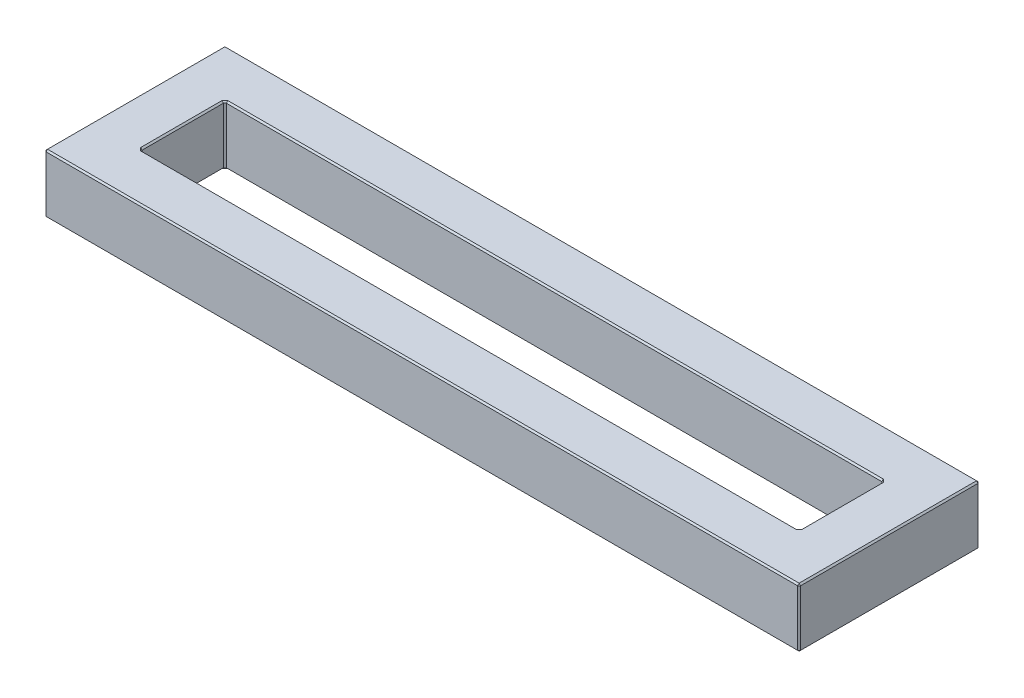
ISO-10303-21;
HEADER;
FILE_DESCRIPTION(('STEP AP214'),'2;1');
FILE_NAME('part.step','',(''),(''),'','','');
FILE_SCHEMA(('AUTOMOTIVE_DESIGN { 1 0 10303 214 1 1 1 1 }'));
ENDSEC;
DATA;
#1=APPLICATION_CONTEXT('core data for automotive mechanical design processes');
#2=APPLICATION_PROTOCOL_DEFINITION('international standard','automotive_design',2000,#1);
#3=PRODUCT_CONTEXT('',#1,'mechanical');
#4=PRODUCT('Part','Part','',(#3));
#5=PRODUCT_RELATED_PRODUCT_CATEGORY('part','',(#4));
#6=PRODUCT_DEFINITION_FORMATION('','',#4);
#7=PRODUCT_DEFINITION_CONTEXT('part definition',#1,'design');
#8=PRODUCT_DEFINITION('design','',#6,#7);
#9=PRODUCT_DEFINITION_SHAPE('','',#8);
#10=(LENGTH_UNIT() NAMED_UNIT(*) SI_UNIT(.MILLI.,.METRE.));
#11=(NAMED_UNIT(*) PLANE_ANGLE_UNIT() SI_UNIT($,.RADIAN.));
#12=(NAMED_UNIT(*) SI_UNIT($,.STERADIAN.) SOLID_ANGLE_UNIT());
#13=UNCERTAINTY_MEASURE_WITH_UNIT(LENGTH_MEASURE(1.E-05),#10,'distance_accuracy_value','');
#14=(GEOMETRIC_REPRESENTATION_CONTEXT(3) GLOBAL_UNCERTAINTY_ASSIGNED_CONTEXT((#13)) GLOBAL_UNIT_ASSIGNED_CONTEXT((#10,
#11,#12)) REPRESENTATION_CONTEXT('',''));
#15=CARTESIAN_POINT('',(0.,0.,0.));
#16=DIRECTION('',(0.,0.,1.));
#17=DIRECTION('',(1.,0.,0.));
#18=AXIS2_PLACEMENT_3D('',#15,#16,#17);
#19=CARTESIAN_POINT('',(0.,9.8,0.));
#20=DIRECTION('',(0.,1.,0.));
#21=DIRECTION('',(0.,0.,1.));
#22=AXIS2_PLACEMENT_3D('',#19,#20,#21);
#23=PLANE('',#22);
#24=DIRECTION('',(1.,0.,0.));
#25=VECTOR('',#24,1.);
#26=CARTESIAN_POINT('',(62.7500000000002,9.8,14.7500000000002));
#27=LINE('',#26,#25);
#28=CARTESIAN_POINT('',(-62.4999999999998,9.8,14.7500000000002));
#29=VERTEX_POINT('',#28);
#30=CARTESIAN_POINT('',(62.5000000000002,9.8,14.7500000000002));
#31=VERTEX_POINT('',#30);
#32=EDGE_CURVE('E563',#29,#31,#27,.T.);
#33=ORIENTED_EDGE('',*,*,#32,.T.);
#34=DIRECTION('',(0.,0.,-1.));
#35=VECTOR('',#34,1.);
#36=CARTESIAN_POINT('',(62.5000000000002,9.8,0.));
#37=LINE('',#36,#35);
#38=CARTESIAN_POINT('',(62.5000000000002,9.8,-14.7499999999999));
#39=VERTEX_POINT('',#38);
#40=EDGE_CURVE('E557',#31,#39,#37,.T.);
#41=ORIENTED_EDGE('',*,*,#40,.T.);
#42=DIRECTION('',(-1.,0.,0.));
#43=VECTOR('',#42,1.);
#44=CARTESIAN_POINT('',(0.,9.8,-14.7499999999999));
#45=LINE('',#44,#43);
#46=CARTESIAN_POINT('',(-62.4999999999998,9.8,-14.7499999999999));
#47=VERTEX_POINT('',#46);
#48=EDGE_CURVE('E570',#39,#47,#45,.T.);
#49=ORIENTED_EDGE('',*,*,#48,.T.);
#50=DIRECTION('',(0.,0.,1.));
#51=VECTOR('',#50,1.);
#52=CARTESIAN_POINT('',(-62.4999999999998,9.8,15.0000000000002));
#53=LINE('',#52,#51);
#54=EDGE_CURVE('E509',#47,#29,#53,.T.);
#55=ORIENTED_EDGE('',*,*,#54,.T.);
#56=EDGE_LOOP('',(#33,#41,#49,#55));
#57=FACE_BOUND('',#56,.T.);
#58=DIRECTION('',(0.707106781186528,0.,0.707106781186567));
#59=VECTOR('',#58,1.);
#60=CARTESIAN_POINT('',(-30.8750000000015,9.8,30.8749999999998));
#61=LINE('',#60,#59);
#62=CARTESIAN_POINT('',(-54.9999999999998,9.8,6.75000000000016));
#63=VERTEX_POINT('',#62);
#64=CARTESIAN_POINT('',(-54.7499999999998,9.8,7.00000000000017));
#65=VERTEX_POINT('',#64);
#66=EDGE_CURVE('E253',#63,#65,#61,.T.);
#67=ORIENTED_EDGE('',*,*,#66,.F.);
#68=DIRECTION('',(0.,0.,-1.));
#69=VECTOR('',#68,1.);
#70=CARTESIAN_POINT('',(-54.9999999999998,9.8,-6.99999999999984));
#71=LINE('',#70,#69);
#72=CARTESIAN_POINT('',(-54.9999999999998,9.8,-6.74999999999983));
#73=VERTEX_POINT('',#72);
#74=EDGE_CURVE('E261',#63,#73,#71,.T.);
#75=ORIENTED_EDGE('',*,*,#74,.T.);
#76=DIRECTION('',(-0.707106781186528,0.,0.707106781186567));
#77=VECTOR('',#76,1.);
#78=CARTESIAN_POINT('',(-30.8750000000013,9.8,-30.8749999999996));
#79=LINE('',#78,#77);
#80=CARTESIAN_POINT('',(-54.7499999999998,9.8,-6.99999999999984));
#81=VERTEX_POINT('',#80);
#82=EDGE_CURVE('E597',#81,#73,#79,.T.);
#83=ORIENTED_EDGE('',*,*,#82,.F.);
#84=DIRECTION('',(-0.707106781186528,0.,0.707106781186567));
#85=VECTOR('',#84,1.);
#86=CARTESIAN_POINT('',(-30.8750000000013,9.8,-30.8749999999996));
#87=LINE('',#86,#85);
#88=CARTESIAN_POINT('',(-54.4999999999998,9.8,-7.24999999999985));
#89=VERTEX_POINT('',#88);
#90=EDGE_CURVE('E583',#89,#81,#87,.T.);
#91=ORIENTED_EDGE('',*,*,#90,.F.);
#92=DIRECTION('',(1.,0.,0.));
#93=VECTOR('',#92,1.);
#94=CARTESIAN_POINT('',(0.,9.8,-7.24999999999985));
#95=LINE('',#94,#93);
#96=CARTESIAN_POINT('',(54.5000000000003,9.8,-7.24999999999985));
#97=VERTEX_POINT('',#96);
#98=EDGE_CURVE('E577',#89,#97,#95,.T.);
#99=ORIENTED_EDGE('',*,*,#98,.T.);
#100=DIRECTION('',(-0.707106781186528,0.,-0.707106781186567));
#101=VECTOR('',#100,1.);
#102=CARTESIAN_POINT('',(30.8750000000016,9.8,-30.8749999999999));
#103=LINE('',#102,#101);
#104=CARTESIAN_POINT('',(54.7500000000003,9.8,-6.99999999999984));
#105=VERTEX_POINT('',#104);
#106=EDGE_CURVE('E562',#105,#97,#103,.T.);
#107=ORIENTED_EDGE('',*,*,#106,.F.);
#108=DIRECTION('',(-0.707106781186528,0.,-0.707106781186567));
#109=VECTOR('',#108,1.);
#110=CARTESIAN_POINT('',(30.8750000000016,9.8,-30.8749999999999));
#111=LINE('',#110,#109);
#112=CARTESIAN_POINT('',(55.0000000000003,9.8,-6.74999999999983));
#113=VERTEX_POINT('',#112);
#114=EDGE_CURVE('E568',#113,#105,#111,.T.);
#115=ORIENTED_EDGE('',*,*,#114,.F.);
#116=DIRECTION('',(0.,0.,1.));
#117=VECTOR('',#116,1.);
#118=CARTESIAN_POINT('',(55.0000000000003,9.8,0.));
#119=LINE('',#118,#117);
#120=CARTESIAN_POINT('',(55.0000000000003,9.8,6.75000000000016));
#121=VERTEX_POINT('',#120);
#122=EDGE_CURVE('E580',#113,#121,#119,.T.);
#123=ORIENTED_EDGE('',*,*,#122,.T.);
#124=DIRECTION('',(0.707106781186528,0.,-0.707106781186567));
#125=VECTOR('',#124,1.);
#126=CARTESIAN_POINT('',(30.8750000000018,9.8,30.875));
#127=LINE('',#126,#125);
#128=CARTESIAN_POINT('',(54.7500000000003,9.8,7.00000000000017));
#129=VERTEX_POINT('',#128);
#130=EDGE_CURVE('E587',#129,#121,#127,.T.);
#131=ORIENTED_EDGE('',*,*,#130,.F.);
#132=DIRECTION('',(0.707106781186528,0.,-0.707106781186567));
#133=VECTOR('',#132,1.);
#134=CARTESIAN_POINT('',(30.8750000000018,9.8,30.875));
#135=LINE('',#134,#133);
#136=CARTESIAN_POINT('',(54.5000000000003,9.8,7.25000000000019));
#137=VERTEX_POINT('',#136);
#138=EDGE_CURVE('E591',#137,#129,#135,.T.);
#139=ORIENTED_EDGE('',*,*,#138,.F.);
#140=DIRECTION('',(-1.,0.,0.));
#141=VECTOR('',#140,1.);
#142=CARTESIAN_POINT('',(-54.7499999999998,9.8,7.25000000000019));
#143=LINE('',#142,#141);
#144=CARTESIAN_POINT('',(-54.4999999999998,9.8,7.25000000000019));
#145=VERTEX_POINT('',#144);
#146=EDGE_CURVE('E256',#137,#145,#143,.T.);
#147=ORIENTED_EDGE('',*,*,#146,.T.);
#148=DIRECTION('',(0.707106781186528,0.,0.707106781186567));
#149=VECTOR('',#148,1.);
#150=CARTESIAN_POINT('',(-30.8750000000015,9.8,30.8749999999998));
#151=LINE('',#150,#149);
#152=EDGE_CURVE('E250',#65,#145,#151,.T.);
#153=ORIENTED_EDGE('',*,*,#152,.F.);
#154=EDGE_LOOP('',(#67,#75,#83,#91,#99,#107,#115,#123,#131,#139,#147,#153));
#155=FACE_BOUND('',#154,.T.);
#156=ADVANCED_FACE('F41',(#57,#155),#23,.T.);
#157=CARTESIAN_POINT('',(0.,0.,0.));
#158=DIRECTION('',(0.,1.,0.));
#159=DIRECTION('',(0.,0.,1.));
#160=AXIS2_PLACEMENT_3D('',#157,#158,#159);
#161=PLANE('',#160);
#162=DIRECTION('',(0.,0.,-1.));
#163=VECTOR('',#162,1.);
#164=CARTESIAN_POINT('',(-62.4999999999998,0.,0.));
#165=LINE('',#164,#163);
#166=CARTESIAN_POINT('',(-62.4999999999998,0.,14.7500000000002));
#167=VERTEX_POINT('',#166);
#168=CARTESIAN_POINT('',(-62.4999999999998,0.,-14.7499999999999));
#169=VERTEX_POINT('',#168);
#170=EDGE_CURVE('E526',#167,#169,#165,.T.);
#171=ORIENTED_EDGE('',*,*,#170,.T.);
#172=DIRECTION('',(1.,0.,0.));
#173=VECTOR('',#172,1.);
#174=CARTESIAN_POINT('',(62.7500000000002,0.,-14.7499999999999));
#175=LINE('',#174,#173);
#176=CARTESIAN_POINT('',(62.5000000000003,0.,-14.7499999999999));
#177=VERTEX_POINT('',#176);
#178=EDGE_CURVE('E689',#169,#177,#175,.T.);
#179=ORIENTED_EDGE('',*,*,#178,.T.);
#180=DIRECTION('',(0.,0.,1.));
#181=VECTOR('',#180,1.);
#182=CARTESIAN_POINT('',(62.5000000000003,0.,15.0000000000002));
#183=LINE('',#182,#181);
#184=CARTESIAN_POINT('',(62.5000000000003,0.,14.7500000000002));
#185=VERTEX_POINT('',#184);
#186=EDGE_CURVE('E684',#177,#185,#183,.T.);
#187=ORIENTED_EDGE('',*,*,#186,.T.);
#188=DIRECTION('',(-1.,0.,0.));
#189=VECTOR('',#188,1.);
#190=CARTESIAN_POINT('',(0.,0.,14.7500000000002));
#191=LINE('',#190,#189);
#192=EDGE_CURVE('E542',#185,#167,#191,.T.);
#193=ORIENTED_EDGE('',*,*,#192,.T.);
#194=EDGE_LOOP('',(#171,#179,#187,#193));
#195=FACE_BOUND('',#194,.T.);
#196=DIRECTION('',(-0.707106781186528,0.,0.707106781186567));
#197=VECTOR('',#196,1.);
#198=CARTESIAN_POINT('',(54.5000000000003,0.,7.25000000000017));
#199=LINE('',#198,#197);
#200=CARTESIAN_POINT('',(54.7500000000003,0.,7.00000000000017));
#201=VERTEX_POINT('',#200);
#202=CARTESIAN_POINT('',(54.5000000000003,0.,7.25000000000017));
#203=VERTEX_POINT('',#202);
#204=EDGE_CURVE('E738',#201,#203,#199,.T.);
#205=ORIENTED_EDGE('',*,*,#204,.F.);
#206=DIRECTION('',(-0.707106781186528,0.,0.707106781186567));
#207=VECTOR('',#206,1.);
#208=CARTESIAN_POINT('',(54.5000000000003,0.,7.25000000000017));
#209=LINE('',#208,#207);
#210=CARTESIAN_POINT('',(55.0000000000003,0.,6.75000000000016));
#211=VERTEX_POINT('',#210);
#212=EDGE_CURVE('E730',#211,#201,#209,.T.);
#213=ORIENTED_EDGE('',*,*,#212,.F.);
#214=DIRECTION('',(0.,0.,-1.));
#215=VECTOR('',#214,1.);
#216=CARTESIAN_POINT('',(55.0000000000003,0.,-6.99999999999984));
#217=LINE('',#216,#215);
#218=CARTESIAN_POINT('',(55.0000000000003,0.,-6.74999999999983));
#219=VERTEX_POINT('',#218);
#220=EDGE_CURVE('E719',#211,#219,#217,.T.);
#221=ORIENTED_EDGE('',*,*,#220,.T.);
#222=DIRECTION('',(0.707106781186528,0.,0.707106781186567));
#223=VECTOR('',#222,1.);
#224=CARTESIAN_POINT('',(55.0000000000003,0.,-6.74999999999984));
#225=LINE('',#224,#223);
#226=CARTESIAN_POINT('',(54.7500000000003,0.,-6.99999999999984));
#227=VERTEX_POINT('',#226);
#228=EDGE_CURVE('E715',#227,#219,#225,.T.);
#229=ORIENTED_EDGE('',*,*,#228,.F.);
#230=DIRECTION('',(0.707106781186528,0.,0.707106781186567));
#231=VECTOR('',#230,1.);
#232=CARTESIAN_POINT('',(55.0000000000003,0.,-6.74999999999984));
#233=LINE('',#232,#231);
#234=CARTESIAN_POINT('',(54.5000000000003,0.,-7.24999999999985));
#235=VERTEX_POINT('',#234);
#236=EDGE_CURVE('E708',#235,#227,#233,.T.);
#237=ORIENTED_EDGE('',*,*,#236,.F.);
#238=DIRECTION('',(-1.,0.,0.));
#239=VECTOR('',#238,1.);
#240=CARTESIAN_POINT('',(-54.7499999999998,0.,-7.24999999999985));
#241=LINE('',#240,#239);
#242=CARTESIAN_POINT('',(-54.4999999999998,0.,-7.24999999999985));
#243=VERTEX_POINT('',#242);
#244=EDGE_CURVE('E705',#235,#243,#241,.T.);
#245=ORIENTED_EDGE('',*,*,#244,.T.);
#246=DIRECTION('',(0.707106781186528,0.,-0.707106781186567));
#247=VECTOR('',#246,1.);
#248=CARTESIAN_POINT('',(-54.4999999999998,0.,-7.24999999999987));
#249=LINE('',#248,#247);
#250=CARTESIAN_POINT('',(-54.7499999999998,0.,-6.99999999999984));
#251=VERTEX_POINT('',#250);
#252=EDGE_CURVE('E694',#251,#243,#249,.T.);
#253=ORIENTED_EDGE('',*,*,#252,.F.);
#254=DIRECTION('',(0.707106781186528,0.,-0.707106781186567));
#255=VECTOR('',#254,1.);
#256=CARTESIAN_POINT('',(-54.4999999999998,0.,-7.24999999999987));
#257=LINE('',#256,#255);
#258=CARTESIAN_POINT('',(-54.9999999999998,0.,-6.74999999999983));
#259=VERTEX_POINT('',#258);
#260=EDGE_CURVE('E698',#259,#251,#257,.T.);
#261=ORIENTED_EDGE('',*,*,#260,.F.);
#262=DIRECTION('',(0.,0.,1.));
#263=VECTOR('',#262,1.);
#264=CARTESIAN_POINT('',(-54.9999999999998,0.,0.));
#265=LINE('',#264,#263);
#266=CARTESIAN_POINT('',(-54.9999999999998,0.,6.75000000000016));
#267=VERTEX_POINT('',#266);
#268=EDGE_CURVE('E712',#259,#267,#265,.T.);
#269=ORIENTED_EDGE('',*,*,#268,.T.);
#270=DIRECTION('',(-0.707106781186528,0.,-0.707106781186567));
#271=VECTOR('',#270,1.);
#272=CARTESIAN_POINT('',(-54.9999999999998,0.,6.75000000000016));
#273=LINE('',#272,#271);
#274=CARTESIAN_POINT('',(-54.7499999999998,0.,7.00000000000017));
#275=VERTEX_POINT('',#274);
#276=EDGE_CURVE('E722',#275,#267,#273,.T.);
#277=ORIENTED_EDGE('',*,*,#276,.F.);
#278=DIRECTION('',(-0.707106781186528,0.,-0.707106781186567));
#279=VECTOR('',#278,1.);
#280=CARTESIAN_POINT('',(-54.9999999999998,0.,6.75000000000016));
#281=LINE('',#280,#279);
#282=CARTESIAN_POINT('',(-54.4999999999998,0.,7.25000000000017));
#283=VERTEX_POINT('',#282);
#284=EDGE_CURVE('E726',#283,#275,#281,.T.);
#285=ORIENTED_EDGE('',*,*,#284,.F.);
#286=DIRECTION('',(1.,0.,0.));
#287=VECTOR('',#286,1.);
#288=CARTESIAN_POINT('',(0.,0.,7.25000000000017));
#289=LINE('',#288,#287);
#290=EDGE_CURVE('E734',#283,#203,#289,.T.);
#291=ORIENTED_EDGE('',*,*,#290,.T.);
#292=EDGE_LOOP('',(#205,#213,#221,#229,#237,#245,#253,#261,#269,#277,#285,#291));
#293=FACE_BOUND('',#292,.T.);
#294=ADVANCED_FACE('F691',(#195,#293),#161,.F.);
#295=CARTESIAN_POINT('',(0.,9.8,7.00000000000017));
#296=DIRECTION('',(0.,0.,1.));
#297=DIRECTION('',(1.,0.,0.));
#298=AXIS2_PLACEMENT_3D('',#295,#296,#297);
#299=PLANE('',#298);
#300=DIRECTION('',(1.,0.,0.));
#301=VECTOR('',#300,1.);
#302=CARTESIAN_POINT('',(54.7500000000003,9.55,7.00000000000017));
#303=LINE('',#302,#301);
#304=CARTESIAN_POINT('',(-54.4999999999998,9.55,7.00000000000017));
#305=VERTEX_POINT('',#304);
#306=CARTESIAN_POINT('',(54.5000000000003,9.55,7.00000000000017));
#307=VERTEX_POINT('',#306);
#308=EDGE_CURVE('E406',#305,#307,#303,.T.);
#309=ORIENTED_EDGE('',*,*,#308,.T.);
#310=DIRECTION('',(0.,-1.,0.));
#311=VECTOR('',#310,1.);
#312=CARTESIAN_POINT('',(54.5000000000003,9.8,7.00000000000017));
#313=LINE('',#312,#311);
#314=CARTESIAN_POINT('',(54.5000000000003,0.250000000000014,7.00000000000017));
#315=VERTEX_POINT('',#314);
#316=EDGE_CURVE('E787',#307,#315,#313,.T.);
#317=ORIENTED_EDGE('',*,*,#316,.T.);
#318=DIRECTION('',(-1.,0.,0.));
#319=VECTOR('',#318,1.);
#320=CARTESIAN_POINT('',(0.,0.250000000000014,7.00000000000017));
#321=LINE('',#320,#319);
#322=CARTESIAN_POINT('',(-54.4999999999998,0.250000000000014,7.00000000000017));
#323=VERTEX_POINT('',#322);
#324=EDGE_CURVE('E791',#315,#323,#321,.T.);
#325=ORIENTED_EDGE('',*,*,#324,.T.);
#326=DIRECTION('',(0.,1.,0.));
#327=VECTOR('',#326,1.);
#328=CARTESIAN_POINT('',(-54.4999999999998,9.8,7.00000000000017));
#329=LINE('',#328,#327);
#330=EDGE_CURVE('E639',#323,#305,#329,.T.);
#331=ORIENTED_EDGE('',*,*,#330,.T.);
#332=EDGE_LOOP('',(#309,#317,#325,#331));
#333=FACE_BOUND('',#332,.T.);
#334=ADVANCED_FACE('F798',(#333),#299,.F.);
#335=CARTESIAN_POINT('',(-54.7499999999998,9.8,0.));
#336=DIRECTION('',(-1.,0.,0.));
#337=DIRECTION('',(0.,0.,1.));
#338=AXIS2_PLACEMENT_3D('',#335,#336,#337);
#339=PLANE('',#338);
#340=DIRECTION('',(0.,0.,1.));
#341=VECTOR('',#340,1.);
#342=CARTESIAN_POINT('',(-54.7499999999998,9.55,7.00000000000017));
#343=LINE('',#342,#341);
#344=CARTESIAN_POINT('',(-54.7499999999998,9.55,-6.74999999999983));
#345=VERTEX_POINT('',#344);
#346=CARTESIAN_POINT('',(-54.7499999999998,9.55,6.75000000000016));
#347=VERTEX_POINT('',#346);
#348=EDGE_CURVE('E605',#345,#347,#343,.T.);
#349=ORIENTED_EDGE('',*,*,#348,.T.);
#350=DIRECTION('',(0.,-1.,0.));
#351=VECTOR('',#350,1.);
#352=CARTESIAN_POINT('',(-54.7499999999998,0.,6.75000000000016));
#353=LINE('',#352,#351);
#354=CARTESIAN_POINT('',(-54.7499999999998,0.250000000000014,6.75000000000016));
#355=VERTEX_POINT('',#354);
#356=EDGE_CURVE('E641',#347,#355,#353,.T.);
#357=ORIENTED_EDGE('',*,*,#356,.T.);
#358=DIRECTION('',(0.,0.,-1.));
#359=VECTOR('',#358,1.);
#360=CARTESIAN_POINT('',(-54.7499999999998,0.250000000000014,0.));
#361=LINE('',#360,#359);
#362=CARTESIAN_POINT('',(-54.7499999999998,0.250000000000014,-6.74999999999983));
#363=VERTEX_POINT('',#362);
#364=EDGE_CURVE('E646',#355,#363,#361,.T.);
#365=ORIENTED_EDGE('',*,*,#364,.T.);
#366=DIRECTION('',(0.,1.,0.));
#367=VECTOR('',#366,1.);
#368=CARTESIAN_POINT('',(-54.7499999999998,9.8,-6.74999999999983));
#369=LINE('',#368,#367);
#370=EDGE_CURVE('E651',#363,#345,#369,.T.);
#371=ORIENTED_EDGE('',*,*,#370,.T.);
#372=EDGE_LOOP('',(#349,#357,#365,#371));
#373=FACE_BOUND('',#372,.T.);
#374=ADVANCED_FACE('F745',(#373),#339,.F.);
#375=CARTESIAN_POINT('',(0.,9.8,-6.99999999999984));
#376=DIRECTION('',(0.,0.,1.));
#377=DIRECTION('',(1.,0.,0.));
#378=AXIS2_PLACEMENT_3D('',#375,#376,#377);
#379=PLANE('',#378);
#380=DIRECTION('',(-1.,0.,0.));
#381=VECTOR('',#380,1.);
#382=CARTESIAN_POINT('',(0.,9.55,-6.99999999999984));
#383=LINE('',#382,#381);
#384=CARTESIAN_POINT('',(54.5000000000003,9.55,-6.99999999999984));
#385=VERTEX_POINT('',#384);
#386=CARTESIAN_POINT('',(-54.4999999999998,9.55,-6.99999999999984));
#387=VERTEX_POINT('',#386);
#388=EDGE_CURVE('E614',#385,#387,#383,.T.);
#389=ORIENTED_EDGE('',*,*,#388,.T.);
#390=DIRECTION('',(0.,-1.,0.));
#391=VECTOR('',#390,1.);
#392=CARTESIAN_POINT('',(-54.4999999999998,9.8,-6.99999999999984));
#393=LINE('',#392,#391);
#394=CARTESIAN_POINT('',(-54.4999999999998,0.25,-6.99999999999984));
#395=VERTEX_POINT('',#394);
#396=EDGE_CURVE('E660',#387,#395,#393,.T.);
#397=ORIENTED_EDGE('',*,*,#396,.T.);
#398=DIRECTION('',(1.,0.,0.));
#399=VECTOR('',#398,1.);
#400=CARTESIAN_POINT('',(54.7500000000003,0.25,-6.99999999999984));
#401=LINE('',#400,#399);
#402=CARTESIAN_POINT('',(54.5000000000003,0.25,-6.99999999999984));
#403=VERTEX_POINT('',#402);
#404=EDGE_CURVE('E657',#395,#403,#401,.T.);
#405=ORIENTED_EDGE('',*,*,#404,.T.);
#406=DIRECTION('',(0.,1.,0.));
#407=VECTOR('',#406,1.);
#408=CARTESIAN_POINT('',(54.5000000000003,9.8,-6.99999999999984));
#409=LINE('',#408,#407);
#410=EDGE_CURVE('E645',#403,#385,#409,.T.);
#411=ORIENTED_EDGE('',*,*,#410,.T.);
#412=EDGE_LOOP('',(#389,#397,#405,#411));
#413=FACE_BOUND('',#412,.T.);
#414=ADVANCED_FACE('F751',(#413),#379,.T.);
#415=CARTESIAN_POINT('',(62.7500000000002,9.8,0.));
#416=DIRECTION('',(1.,0.,0.));
#417=DIRECTION('',(0.,0.,-1.));
#418=AXIS2_PLACEMENT_3D('',#415,#416,#417);
#419=PLANE('',#418);
#420=DIRECTION('',(0.,0.,-1.));
#421=VECTOR('',#420,1.);
#422=CARTESIAN_POINT('',(62.7500000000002,0.249999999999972,-14.9999999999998));
#423=LINE('',#422,#421);
#424=CARTESIAN_POINT('',(62.7500000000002,0.249999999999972,14.7500000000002));
#425=VERTEX_POINT('',#424);
#426=CARTESIAN_POINT('',(62.7500000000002,0.249999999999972,-14.7499999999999));
#427=VERTEX_POINT('',#426);
#428=EDGE_CURVE('E291',#425,#427,#423,.T.);
#429=ORIENTED_EDGE('',*,*,#428,.T.);
#430=DIRECTION('',(0.,1.,0.));
#431=VECTOR('',#430,1.);
#432=CARTESIAN_POINT('',(62.7500000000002,9.8,-14.7499999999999));
#433=LINE('',#432,#431);
#434=CARTESIAN_POINT('',(62.7500000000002,9.55000000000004,-14.7499999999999));
#435=VERTEX_POINT('',#434);
#436=EDGE_CURVE('E294',#427,#435,#433,.T.);
#437=ORIENTED_EDGE('',*,*,#436,.T.);
#438=DIRECTION('',(0.,0.,1.));
#439=VECTOR('',#438,1.);
#440=CARTESIAN_POINT('',(62.7500000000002,9.55000000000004,0.));
#441=LINE('',#440,#439);
#442=CARTESIAN_POINT('',(62.7500000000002,9.55000000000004,14.7500000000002));
#443=VERTEX_POINT('',#442);
#444=EDGE_CURVE('E285',#435,#443,#441,.T.);
#445=ORIENTED_EDGE('',*,*,#444,.T.);
#446=DIRECTION('',(0.,-1.,0.));
#447=VECTOR('',#446,1.);
#448=CARTESIAN_POINT('',(62.7500000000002,0.,14.7500000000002));
#449=LINE('',#448,#447);
#450=EDGE_CURVE('E288',#443,#425,#449,.T.);
#451=ORIENTED_EDGE('',*,*,#450,.T.);
#452=EDGE_LOOP('',(#429,#437,#445,#451));
#453=FACE_BOUND('',#452,.T.);
#454=ADVANCED_FACE('F849',(#453),#419,.T.);
#455=CARTESIAN_POINT('',(0.,9.8,-14.9999999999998));
#456=DIRECTION('',(0.,0.,-1.));
#457=DIRECTION('',(-1.,0.,0.));
#458=AXIS2_PLACEMENT_3D('',#455,#456,#457);
#459=PLANE('',#458);
#460=DIRECTION('',(0.,-1.,0.));
#461=VECTOR('',#460,1.);
#462=CARTESIAN_POINT('',(62.5000000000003,9.8,-14.9999999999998));
#463=LINE('',#462,#461);
#464=CARTESIAN_POINT('',(62.5000000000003,9.55000000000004,-14.9999999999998));
#465=VERTEX_POINT('',#464);
#466=CARTESIAN_POINT('',(62.5000000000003,0.249999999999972,-14.9999999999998));
#467=VERTEX_POINT('',#466);
#468=EDGE_CURVE('E278',#465,#467,#463,.T.);
#469=ORIENTED_EDGE('',*,*,#468,.T.);
#470=DIRECTION('',(-1.,0.,0.));
#471=VECTOR('',#470,1.);
#472=CARTESIAN_POINT('',(-62.7499999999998,0.249999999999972,-14.9999999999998));
#473=LINE('',#472,#471);
#474=CARTESIAN_POINT('',(-62.4999999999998,0.249999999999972,-14.9999999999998));
#475=VERTEX_POINT('',#474);
#476=EDGE_CURVE('E281',#467,#475,#473,.T.);
#477=ORIENTED_EDGE('',*,*,#476,.T.);
#478=DIRECTION('',(0.,1.,0.));
#479=VECTOR('',#478,1.);
#480=CARTESIAN_POINT('',(-62.4999999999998,9.8,-14.9999999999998));
#481=LINE('',#480,#479);
#482=CARTESIAN_POINT('',(-62.4999999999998,9.55000000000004,-14.9999999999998));
#483=VERTEX_POINT('',#482);
#484=EDGE_CURVE('E269',#475,#483,#481,.T.);
#485=ORIENTED_EDGE('',*,*,#484,.T.);
#486=DIRECTION('',(1.,0.,0.));
#487=VECTOR('',#486,1.);
#488=CARTESIAN_POINT('',(0.,9.55000000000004,-14.9999999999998));
#489=LINE('',#488,#487);
#490=EDGE_CURVE('E272',#483,#465,#489,.T.);
#491=ORIENTED_EDGE('',*,*,#490,.T.);
#492=EDGE_LOOP('',(#469,#477,#485,#491));
#493=FACE_BOUND('',#492,.T.);
#494=ADVANCED_FACE('F672',(#493),#459,.T.);
#495=CARTESIAN_POINT('',(-62.7499999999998,9.8,0.));
#496=DIRECTION('',(1.,0.,0.));
#497=DIRECTION('',(0.,0.,-1.));
#498=AXIS2_PLACEMENT_3D('',#495,#496,#497);
#499=PLANE('',#498);
#500=DIRECTION('',(0.,-1.,0.));
#501=VECTOR('',#500,1.);
#502=CARTESIAN_POINT('',(-62.7499999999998,0.,-14.7499999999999));
#503=LINE('',#502,#501);
#504=CARTESIAN_POINT('',(-62.7499999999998,9.55000000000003,-14.7499999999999));
#505=VERTEX_POINT('',#504);
#506=CARTESIAN_POINT('',(-62.7499999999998,0.249999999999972,-14.7499999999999));
#507=VERTEX_POINT('',#506);
#508=EDGE_CURVE('E51',#505,#507,#503,.T.);
#509=ORIENTED_EDGE('',*,*,#508,.T.);
#510=DIRECTION('',(0.,0.,1.));
#511=VECTOR('',#510,1.);
#512=CARTESIAN_POINT('',(-62.7499999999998,0.249999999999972,0.));
#513=LINE('',#512,#511);
#514=CARTESIAN_POINT('',(-62.7499999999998,0.249999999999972,14.7500000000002));
#515=VERTEX_POINT('',#514);
#516=EDGE_CURVE('E11',#507,#515,#513,.T.);
#517=ORIENTED_EDGE('',*,*,#516,.T.);
#518=DIRECTION('',(0.,1.,0.));
#519=VECTOR('',#518,1.);
#520=CARTESIAN_POINT('',(-62.7499999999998,9.8,14.7500000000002));
#521=LINE('',#520,#519);
#522=CARTESIAN_POINT('',(-62.7499999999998,9.55000000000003,14.7500000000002));
#523=VERTEX_POINT('',#522);
#524=EDGE_CURVE('E311',#515,#523,#521,.T.);
#525=ORIENTED_EDGE('',*,*,#524,.T.);
#526=DIRECTION('',(0.,0.,-1.));
#527=VECTOR('',#526,1.);
#528=CARTESIAN_POINT('',(-62.7499999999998,9.55000000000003,-14.9999999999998));
#529=LINE('',#528,#527);
#530=EDGE_CURVE('E62',#523,#505,#529,.T.);
#531=ORIENTED_EDGE('',*,*,#530,.T.);
#532=EDGE_LOOP('',(#509,#517,#525,#531));
#533=FACE_BOUND('',#532,.T.);
#534=ADVANCED_FACE('F528',(#533),#499,.F.);
#535=CARTESIAN_POINT('',(0.,9.8,15.0000000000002));
#536=DIRECTION('',(0.,0.,-1.));
#537=DIRECTION('',(-1.,0.,0.));
#538=AXIS2_PLACEMENT_3D('',#535,#536,#537);
#539=PLANE('',#538);
#540=DIRECTION('',(1.,0.,0.));
#541=VECTOR('',#540,1.);
#542=CARTESIAN_POINT('',(0.,0.249999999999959,15.0000000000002));
#543=LINE('',#542,#541);
#544=CARTESIAN_POINT('',(-62.4999999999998,0.249999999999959,15.0000000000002));
#545=VERTEX_POINT('',#544);
#546=CARTESIAN_POINT('',(62.5000000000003,0.249999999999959,15.0000000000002));
#547=VERTEX_POINT('',#546);
#548=EDGE_CURVE('E304',#545,#547,#543,.T.);
#549=ORIENTED_EDGE('',*,*,#548,.T.);
#550=DIRECTION('',(0.,1.,0.));
#551=VECTOR('',#550,1.);
#552=CARTESIAN_POINT('',(62.5000000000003,9.8,15.0000000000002));
#553=LINE('',#552,#551);
#554=CARTESIAN_POINT('',(62.5000000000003,9.55000000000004,15.0000000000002));
#555=VERTEX_POINT('',#554);
#556=EDGE_CURVE('E307',#547,#555,#553,.T.);
#557=ORIENTED_EDGE('',*,*,#556,.T.);
#558=DIRECTION('',(-1.,0.,0.));
#559=VECTOR('',#558,1.);
#560=CARTESIAN_POINT('',(-62.7499999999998,9.55000000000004,15.0000000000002));
#561=LINE('',#560,#559);
#562=CARTESIAN_POINT('',(-62.4999999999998,9.55000000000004,15.0000000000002));
#563=VERTEX_POINT('',#562);
#564=EDGE_CURVE('E301',#555,#563,#561,.T.);
#565=ORIENTED_EDGE('',*,*,#564,.T.);
#566=DIRECTION('',(0.,-1.,0.));
#567=VECTOR('',#566,1.);
#568=CARTESIAN_POINT('',(-62.4999999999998,9.8,15.0000000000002));
#569=LINE('',#568,#567);
#570=EDGE_CURVE('E298',#563,#545,#569,.T.);
#571=ORIENTED_EDGE('',*,*,#570,.T.);
#572=EDGE_LOOP('',(#549,#557,#565,#571));
#573=FACE_BOUND('',#572,.T.);
#574=ADVANCED_FACE('F535',(#573),#539,.F.);
#575=CARTESIAN_POINT('',(54.7500000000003,9.8,0.));
#576=DIRECTION('',(-1.,0.,0.));
#577=DIRECTION('',(0.,0.,1.));
#578=AXIS2_PLACEMENT_3D('',#575,#576,#577);
#579=PLANE('',#578);
#580=DIRECTION('',(0.,0.,1.));
#581=VECTOR('',#580,1.);
#582=CARTESIAN_POINT('',(54.7500000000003,0.250000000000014,7.00000000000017));
#583=LINE('',#582,#581);
#584=CARTESIAN_POINT('',(54.7500000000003,0.250000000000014,-6.74999999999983));
#585=VERTEX_POINT('',#584);
#586=CARTESIAN_POINT('',(54.7500000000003,0.250000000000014,6.75000000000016));
#587=VERTEX_POINT('',#586);
#588=EDGE_CURVE('E769',#585,#587,#583,.T.);
#589=ORIENTED_EDGE('',*,*,#588,.T.);
#590=DIRECTION('',(0.,1.,0.));
#591=VECTOR('',#590,1.);
#592=CARTESIAN_POINT('',(54.7500000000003,9.8,6.75000000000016));
#593=LINE('',#592,#591);
#594=CARTESIAN_POINT('',(54.7500000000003,9.54999999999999,6.75000000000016));
#595=VERTEX_POINT('',#594);
#596=EDGE_CURVE('E774',#587,#595,#593,.T.);
#597=ORIENTED_EDGE('',*,*,#596,.T.);
#598=DIRECTION('',(0.,0.,-1.));
#599=VECTOR('',#598,1.);
#600=CARTESIAN_POINT('',(54.7500000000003,9.54999999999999,0.));
#601=LINE('',#600,#599);
#602=CARTESIAN_POINT('',(54.7500000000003,9.54999999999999,-6.74999999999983));
#603=VERTEX_POINT('',#602);
#604=EDGE_CURVE('E624',#595,#603,#601,.T.);
#605=ORIENTED_EDGE('',*,*,#604,.T.);
#606=DIRECTION('',(0.,-1.,0.));
#607=VECTOR('',#606,1.);
#608=CARTESIAN_POINT('',(54.7500000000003,0.,-6.74999999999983));
#609=LINE('',#608,#607);
#610=EDGE_CURVE('E779',#603,#585,#609,.T.);
#611=ORIENTED_EDGE('',*,*,#610,.T.);
#612=EDGE_LOOP('',(#589,#597,#605,#611));
#613=FACE_BOUND('',#612,.T.);
#614=ADVANCED_FACE('F820',(#613),#579,.T.);
#615=CARTESIAN_POINT('',(-54.4999999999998,9.8,-6.99999999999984));
#616=DIRECTION('',(-0.707106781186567,0.,-0.707106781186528));
#617=DIRECTION('',(0.,-1.,0.));
#618=AXIS2_PLACEMENT_3D('',#615,#616,#617);
#619=PLANE('',#618);
#620=DIRECTION('',(0.707106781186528,0.,-0.707106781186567));
#621=VECTOR('',#620,1.);
#622=CARTESIAN_POINT('',(-54.4999999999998,9.55,-6.99999999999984));
#623=LINE('',#622,#621);
#624=EDGE_CURVE('E402',#345,#387,#623,.T.);
#625=ORIENTED_EDGE('',*,*,#624,.F.);
#626=ORIENTED_EDGE('',*,*,#370,.F.);
#627=DIRECTION('',(-0.707106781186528,0.,0.707106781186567));
#628=VECTOR('',#627,1.);
#629=CARTESIAN_POINT('',(-54.4999999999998,0.25,-6.99999999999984));
#630=LINE('',#629,#628);
#631=EDGE_CURVE('E398',#395,#363,#630,.T.);
#632=ORIENTED_EDGE('',*,*,#631,.F.);
#633=ORIENTED_EDGE('',*,*,#396,.F.);
#634=EDGE_LOOP('',(#625,#626,#632,#633));
#635=FACE_BOUND('',#634,.T.);
#636=ADVANCED_FACE('F749',(#635),#619,.F.);
#637=CARTESIAN_POINT('',(-54.7499999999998,9.55,-6.74999999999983));
#638=DIRECTION('',(0.577350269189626,0.577350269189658,0.577350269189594));
#639=DIRECTION('',(-0.707106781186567,0.707106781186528,0.));
#640=AXIS2_PLACEMENT_3D('',#637,#638,#639);
#641=PLANE('',#640);
#642=DIRECTION('',(0.707106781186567,-0.707106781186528,0.));
#643=VECTOR('',#642,1.);
#644=CARTESIAN_POINT('',(-54.9999999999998,9.8,-6.74999999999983));
#645=LINE('',#644,#643);
#646=EDGE_CURVE('E391',#345,#73,#645,.F.);
#647=ORIENTED_EDGE('',*,*,#646,.F.);
#648=ORIENTED_EDGE('',*,*,#624,.T.);
#649=DIRECTION('',(0.,0.707106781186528,-0.707106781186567));
#650=VECTOR('',#649,1.);
#651=CARTESIAN_POINT('',(-54.4999999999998,9.55,-6.99999999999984));
#652=LINE('',#651,#650);
#653=EDGE_CURVE('E394',#89,#387,#652,.F.);
#654=ORIENTED_EDGE('',*,*,#653,.F.);
#655=ORIENTED_EDGE('',*,*,#90,.T.);
#656=ORIENTED_EDGE('',*,*,#82,.T.);
#657=EDGE_LOOP('',(#647,#648,#654,#655,#656));
#658=FACE_BOUND('',#657,.T.);
#659=ADVANCED_FACE('F607',(#658),#641,.T.);
#660=CARTESIAN_POINT('',(-54.4999999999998,0.25,-6.99999999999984));
#661=DIRECTION('',(0.577350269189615,-0.577350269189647,0.577350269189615));
#662=DIRECTION('',(0.,-0.707106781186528,-0.707106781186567));
#663=AXIS2_PLACEMENT_3D('',#660,#661,#662);
#664=PLANE('',#663);
#665=DIRECTION('',(0.,0.707106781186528,0.707106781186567));
#666=VECTOR('',#665,1.);
#667=CARTESIAN_POINT('',(-54.4999999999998,0.,-7.24999999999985));
#668=LINE('',#667,#666);
#669=EDGE_CURVE('E383',#395,#243,#668,.F.);
#670=ORIENTED_EDGE('',*,*,#669,.F.);
#671=ORIENTED_EDGE('',*,*,#631,.T.);
#672=DIRECTION('',(-0.707106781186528,-0.707106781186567,0.));
#673=VECTOR('',#672,1.);
#674=CARTESIAN_POINT('',(-54.7499999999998,0.250000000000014,-6.74999999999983));
#675=LINE('',#674,#673);
#676=EDGE_CURVE('E387',#259,#363,#675,.F.);
#677=ORIENTED_EDGE('',*,*,#676,.F.);
#678=ORIENTED_EDGE('',*,*,#260,.T.);
#679=ORIENTED_EDGE('',*,*,#252,.T.);
#680=EDGE_LOOP('',(#670,#671,#677,#678,#679));
#681=FACE_BOUND('',#680,.T.);
#682=ADVANCED_FACE('F814',(#681),#664,.T.);
#683=CARTESIAN_POINT('',(0.,9.55,-6.99999999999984));
#684=DIRECTION('',(0.,-0.707106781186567,-0.707106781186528));
#685=DIRECTION('',(-1.,0.,0.));
#686=AXIS2_PLACEMENT_3D('',#683,#684,#685);
#687=PLANE('',#686);
#688=ORIENTED_EDGE('',*,*,#653,.T.);
#689=ORIENTED_EDGE('',*,*,#388,.F.);
#690=DIRECTION('',(0.,-0.707106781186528,0.707106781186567));
#691=VECTOR('',#690,1.);
#692=CARTESIAN_POINT('',(54.5000000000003,9.8,-7.24999999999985));
#693=LINE('',#692,#691);
#694=EDGE_CURVE('E375',#97,#385,#693,.T.);
#695=ORIENTED_EDGE('',*,*,#694,.F.);
#696=ORIENTED_EDGE('',*,*,#98,.F.);
#697=EDGE_LOOP('',(#688,#689,#695,#696));
#698=FACE_BOUND('',#697,.T.);
#699=ADVANCED_FACE('F613',(#698),#687,.F.);
#700=CARTESIAN_POINT('',(-54.9999999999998,9.8,0.));
#701=DIRECTION('',(0.707106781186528,0.707106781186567,0.));
#702=DIRECTION('',(0.,0.,1.));
#703=AXIS2_PLACEMENT_3D('',#700,#701,#702);
#704=PLANE('',#703);
#705=ORIENTED_EDGE('',*,*,#646,.T.);
#706=ORIENTED_EDGE('',*,*,#74,.F.);
#707=DIRECTION('',(-0.707106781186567,0.707106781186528,0.));
#708=VECTOR('',#707,1.);
#709=CARTESIAN_POINT('',(-54.7499999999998,9.55,6.75000000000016));
#710=LINE('',#709,#708);
#711=EDGE_CURVE('E267',#347,#63,#710,.T.);
#712=ORIENTED_EDGE('',*,*,#711,.F.);
#713=ORIENTED_EDGE('',*,*,#348,.F.);
#714=EDGE_LOOP('',(#705,#706,#712,#713));
#715=FACE_BOUND('',#714,.T.);
#716=ADVANCED_FACE('F602',(#715),#704,.T.);
#717=CARTESIAN_POINT('',(-54.7499999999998,9.8,6.75000000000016));
#718=DIRECTION('',(0.707106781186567,0.,-0.707106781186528));
#719=DIRECTION('',(0.,1.,0.));
#720=AXIS2_PLACEMENT_3D('',#717,#718,#719);
#721=PLANE('',#720);
#722=DIRECTION('',(-0.707106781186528,0.,-0.707106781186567));
#723=VECTOR('',#722,1.);
#724=CARTESIAN_POINT('',(-54.7499999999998,0.250000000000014,6.75000000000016));
#725=LINE('',#724,#723);
#726=EDGE_CURVE('E366',#355,#323,#725,.F.);
#727=ORIENTED_EDGE('',*,*,#726,.F.);
#728=ORIENTED_EDGE('',*,*,#356,.F.);
#729=DIRECTION('',(0.707106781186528,0.,0.707106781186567));
#730=VECTOR('',#729,1.);
#731=CARTESIAN_POINT('',(-54.7499999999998,9.55,6.75000000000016));
#732=LINE('',#731,#730);
#733=EDGE_CURVE('E370',#305,#347,#732,.F.);
#734=ORIENTED_EDGE('',*,*,#733,.F.);
#735=ORIENTED_EDGE('',*,*,#330,.F.);
#736=EDGE_LOOP('',(#727,#728,#734,#735));
#737=FACE_BOUND('',#736,.T.);
#738=ADVANCED_FACE('F638',(#737),#721,.T.);
#739=CARTESIAN_POINT('',(-54.7499999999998,0.250000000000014,0.));
#740=DIRECTION('',(-0.707106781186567,0.707106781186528,0.));
#741=DIRECTION('',(0.,0.,-1.));
#742=AXIS2_PLACEMENT_3D('',#739,#740,#741);
#743=PLANE('',#742);
#744=ORIENTED_EDGE('',*,*,#676,.T.);
#745=ORIENTED_EDGE('',*,*,#364,.F.);
#746=DIRECTION('',(0.707106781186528,0.707106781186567,0.));
#747=VECTOR('',#746,1.);
#748=CARTESIAN_POINT('',(-54.9999999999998,0.,6.75000000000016));
#749=LINE('',#748,#747);
#750=EDGE_CURVE('E363',#267,#355,#749,.T.);
#751=ORIENTED_EDGE('',*,*,#750,.F.);
#752=ORIENTED_EDGE('',*,*,#268,.F.);
#753=EDGE_LOOP('',(#744,#745,#751,#752));
#754=FACE_BOUND('',#753,.T.);
#755=ADVANCED_FACE('F811',(#754),#743,.F.);
#756=CARTESIAN_POINT('',(0.,0.,-7.24999999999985));
#757=DIRECTION('',(0.,-0.707106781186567,0.707106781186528));
#758=DIRECTION('',(1.,0.,0.));
#759=AXIS2_PLACEMENT_3D('',#756,#757,#758);
#760=PLANE('',#759);
#761=ORIENTED_EDGE('',*,*,#669,.T.);
#762=ORIENTED_EDGE('',*,*,#244,.F.);
#763=DIRECTION('',(0.,-0.707106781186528,-0.707106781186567));
#764=VECTOR('',#763,1.);
#765=CARTESIAN_POINT('',(54.5000000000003,0.25,-6.99999999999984));
#766=LINE('',#765,#764);
#767=EDGE_CURVE('E359',#403,#235,#766,.T.);
#768=ORIENTED_EDGE('',*,*,#767,.F.);
#769=ORIENTED_EDGE('',*,*,#404,.F.);
#770=EDGE_LOOP('',(#761,#762,#768,#769));
#771=FACE_BOUND('',#770,.T.);
#772=ADVANCED_FACE('F761',(#771),#760,.T.);
#773=CARTESIAN_POINT('',(54.7500000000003,9.8,-6.74999999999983));
#774=DIRECTION('',(-0.707106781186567,0.,0.707106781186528));
#775=DIRECTION('',(0.,1.,0.));
#776=AXIS2_PLACEMENT_3D('',#773,#774,#775);
#777=PLANE('',#776);
#778=DIRECTION('',(-0.707106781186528,0.,-0.707106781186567));
#779=VECTOR('',#778,1.);
#780=CARTESIAN_POINT('',(54.7500000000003,9.55,-6.74999999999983));
#781=LINE('',#780,#779);
#782=EDGE_CURVE('E379',#385,#603,#781,.F.);
#783=ORIENTED_EDGE('',*,*,#782,.F.);
#784=ORIENTED_EDGE('',*,*,#410,.F.);
#785=DIRECTION('',(0.707106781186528,0.,0.707106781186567));
#786=VECTOR('',#785,1.);
#787=CARTESIAN_POINT('',(54.7500000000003,0.250000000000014,-6.74999999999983));
#788=LINE('',#787,#786);
#789=EDGE_CURVE('E355',#585,#403,#788,.F.);
#790=ORIENTED_EDGE('',*,*,#789,.F.);
#791=ORIENTED_EDGE('',*,*,#610,.F.);
#792=EDGE_LOOP('',(#783,#784,#790,#791));
#793=FACE_BOUND('',#792,.T.);
#794=ADVANCED_FACE('F756',(#793),#777,.T.);
#795=CARTESIAN_POINT('',(54.5000000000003,9.55,-6.99999999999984));
#796=DIRECTION('',(-0.577350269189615,0.577350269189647,0.577350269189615));
#797=DIRECTION('',(0.,-0.707106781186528,0.707106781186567));
#798=AXIS2_PLACEMENT_3D('',#795,#796,#797);
#799=PLANE('',#798);
#800=ORIENTED_EDGE('',*,*,#694,.T.);
#801=ORIENTED_EDGE('',*,*,#782,.T.);
#802=DIRECTION('',(0.707106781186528,0.707106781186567,0.));
#803=VECTOR('',#802,1.);
#804=CARTESIAN_POINT('',(54.7500000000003,9.54999999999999,-6.74999999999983));
#805=LINE('',#804,#803);
#806=EDGE_CURVE('E351',#113,#603,#805,.F.);
#807=ORIENTED_EDGE('',*,*,#806,.F.);
#808=ORIENTED_EDGE('',*,*,#114,.T.);
#809=ORIENTED_EDGE('',*,*,#106,.T.);
#810=EDGE_LOOP('',(#800,#801,#807,#808,#809));
#811=FACE_BOUND('',#810,.T.);
#812=ADVANCED_FACE('F617',(#811),#799,.T.);
#813=CARTESIAN_POINT('',(-54.4999999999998,9.55,7.00000000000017));
#814=DIRECTION('',(0.577350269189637,0.577350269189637,-0.577350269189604));
#815=DIRECTION('',(-0.707106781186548,0.707106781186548,0.));
#816=AXIS2_PLACEMENT_3D('',#813,#814,#815);
#817=PLANE('',#816);
#818=ORIENTED_EDGE('',*,*,#66,.T.);
#819=ORIENTED_EDGE('',*,*,#152,.T.);
#820=DIRECTION('',(0.,-0.707106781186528,-0.707106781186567));
#821=VECTOR('',#820,1.);
#822=CARTESIAN_POINT('',(-54.4999999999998,9.8,7.25000000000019));
#823=LINE('',#822,#821);
#824=EDGE_CURVE('E348',#305,#145,#823,.F.);
#825=ORIENTED_EDGE('',*,*,#824,.F.);
#826=ORIENTED_EDGE('',*,*,#733,.T.);
#827=ORIENTED_EDGE('',*,*,#711,.T.);
#828=EDGE_LOOP('',(#818,#819,#825,#826,#827));
#829=FACE_BOUND('',#828,.T.);
#830=ADVANCED_FACE('F264',(#829),#817,.T.);
#831=CARTESIAN_POINT('',(-54.7499999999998,0.250000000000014,6.75000000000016));
#832=DIRECTION('',(0.577350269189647,-0.577350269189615,-0.577350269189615));
#833=DIRECTION('',(-0.707106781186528,0.,-0.707106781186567));
#834=AXIS2_PLACEMENT_3D('',#831,#832,#833);
#835=PLANE('',#834);
#836=ORIENTED_EDGE('',*,*,#750,.T.);
#837=ORIENTED_EDGE('',*,*,#726,.T.);
#838=DIRECTION('',(0.,-0.707106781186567,0.707106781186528));
#839=VECTOR('',#838,1.);
#840=CARTESIAN_POINT('',(-54.4999999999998,0.250000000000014,7.00000000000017));
#841=LINE('',#840,#839);
#842=EDGE_CURVE('E344',#283,#323,#841,.F.);
#843=ORIENTED_EDGE('',*,*,#842,.F.);
#844=ORIENTED_EDGE('',*,*,#284,.T.);
#845=ORIENTED_EDGE('',*,*,#276,.T.);
#846=EDGE_LOOP('',(#836,#837,#843,#844,#845));
#847=FACE_BOUND('',#846,.T.);
#848=ADVANCED_FACE('F807',(#847),#835,.T.);
#849=CARTESIAN_POINT('',(54.7500000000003,0.250000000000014,-6.74999999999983));
#850=DIRECTION('',(-0.577350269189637,-0.577350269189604,0.577350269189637));
#851=DIRECTION('',(0.707106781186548,0.,0.707106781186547));
#852=AXIS2_PLACEMENT_3D('',#849,#850,#851);
#853=PLANE('',#852);
#854=ORIENTED_EDGE('',*,*,#236,.T.);
#855=ORIENTED_EDGE('',*,*,#228,.T.);
#856=DIRECTION('',(-0.707106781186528,0.707106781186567,0.));
#857=VECTOR('',#856,1.);
#858=CARTESIAN_POINT('',(55.0000000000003,0.,-6.74999999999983));
#859=LINE('',#858,#857);
#860=EDGE_CURVE('E340',#585,#219,#859,.F.);
#861=ORIENTED_EDGE('',*,*,#860,.F.);
#862=ORIENTED_EDGE('',*,*,#789,.T.);
#863=ORIENTED_EDGE('',*,*,#767,.T.);
#864=EDGE_LOOP('',(#854,#855,#861,#862,#863));
#865=FACE_BOUND('',#864,.T.);
#866=ADVANCED_FACE('F764',(#865),#853,.T.);
#867=CARTESIAN_POINT('',(54.7500000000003,9.54999999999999,0.));
#868=DIRECTION('',(0.707106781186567,-0.707106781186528,0.));
#869=DIRECTION('',(0.,0.,-1.));
#870=AXIS2_PLACEMENT_3D('',#867,#868,#869);
#871=PLANE('',#870);
#872=ORIENTED_EDGE('',*,*,#806,.T.);
#873=ORIENTED_EDGE('',*,*,#604,.F.);
#874=DIRECTION('',(-0.707106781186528,-0.707106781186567,0.));
#875=VECTOR('',#874,1.);
#876=CARTESIAN_POINT('',(55.0000000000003,9.8,6.75000000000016));
#877=LINE('',#876,#875);
#878=EDGE_CURVE('E336',#121,#595,#877,.T.);
#879=ORIENTED_EDGE('',*,*,#878,.F.);
#880=ORIENTED_EDGE('',*,*,#122,.F.);
#881=EDGE_LOOP('',(#872,#873,#879,#880));
#882=FACE_BOUND('',#881,.T.);
#883=ADVANCED_FACE('F623',(#882),#871,.F.);
#884=CARTESIAN_POINT('',(0.,9.8,7.25000000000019));
#885=DIRECTION('',(0.,0.707106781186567,-0.707106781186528));
#886=DIRECTION('',(1.,0.,0.));
#887=AXIS2_PLACEMENT_3D('',#884,#885,#886);
#888=PLANE('',#887);
#889=ORIENTED_EDGE('',*,*,#824,.T.);
#890=ORIENTED_EDGE('',*,*,#146,.F.);
#891=DIRECTION('',(0.,0.707106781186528,0.707106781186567));
#892=VECTOR('',#891,1.);
#893=CARTESIAN_POINT('',(54.5000000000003,9.55,7.00000000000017));
#894=LINE('',#893,#892);
#895=EDGE_CURVE('E332',#307,#137,#894,.T.);
#896=ORIENTED_EDGE('',*,*,#895,.F.);
#897=ORIENTED_EDGE('',*,*,#308,.F.);
#898=EDGE_LOOP('',(#889,#890,#896,#897));
#899=FACE_BOUND('',#898,.T.);
#900=ADVANCED_FACE('F631',(#899),#888,.T.);
#901=CARTESIAN_POINT('',(0.,0.250000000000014,7.00000000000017));
#902=DIRECTION('',(0.,0.707106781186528,0.707106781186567));
#903=DIRECTION('',(-1.,0.,0.));
#904=AXIS2_PLACEMENT_3D('',#901,#902,#903);
#905=PLANE('',#904);
#906=ORIENTED_EDGE('',*,*,#842,.T.);
#907=ORIENTED_EDGE('',*,*,#324,.F.);
#908=DIRECTION('',(0.,0.707106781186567,-0.707106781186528));
#909=VECTOR('',#908,1.);
#910=CARTESIAN_POINT('',(54.5000000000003,0.,7.25000000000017));
#911=LINE('',#910,#909);
#912=EDGE_CURVE('E328',#203,#315,#911,.T.);
#913=ORIENTED_EDGE('',*,*,#912,.F.);
#914=ORIENTED_EDGE('',*,*,#290,.F.);
#915=EDGE_LOOP('',(#906,#907,#913,#914));
#916=FACE_BOUND('',#915,.T.);
#917=ADVANCED_FACE('F803',(#916),#905,.F.);
#918=CARTESIAN_POINT('',(55.0000000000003,0.,0.));
#919=DIRECTION('',(-0.707106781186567,-0.707106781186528,0.));
#920=DIRECTION('',(0.,0.,1.));
#921=AXIS2_PLACEMENT_3D('',#918,#919,#920);
#922=PLANE('',#921);
#923=ORIENTED_EDGE('',*,*,#860,.T.);
#924=ORIENTED_EDGE('',*,*,#220,.F.);
#925=DIRECTION('',(0.707106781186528,-0.707106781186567,0.));
#926=VECTOR('',#925,1.);
#927=CARTESIAN_POINT('',(54.7500000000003,0.250000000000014,6.75000000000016));
#928=LINE('',#927,#926);
#929=EDGE_CURVE('E324',#587,#211,#928,.T.);
#930=ORIENTED_EDGE('',*,*,#929,.F.);
#931=ORIENTED_EDGE('',*,*,#588,.F.);
#932=EDGE_LOOP('',(#923,#924,#930,#931));
#933=FACE_BOUND('',#932,.T.);
#934=ADVANCED_FACE('F770',(#933),#922,.T.);
#935=CARTESIAN_POINT('',(54.7500000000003,9.54999999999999,6.75000000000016));
#936=DIRECTION('',(-0.577350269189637,0.577350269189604,-0.577350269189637));
#937=DIRECTION('',(-0.707106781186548,0.,0.707106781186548));
#938=AXIS2_PLACEMENT_3D('',#935,#936,#937);
#939=PLANE('',#938);
#940=ORIENTED_EDGE('',*,*,#130,.T.);
#941=ORIENTED_EDGE('',*,*,#878,.T.);
#942=DIRECTION('',(-0.707106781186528,0.,0.707106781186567));
#943=VECTOR('',#942,1.);
#944=CARTESIAN_POINT('',(54.5000000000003,9.54999999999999,7.00000000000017));
#945=LINE('',#944,#943);
#946=EDGE_CURVE('E321',#307,#595,#945,.F.);
#947=ORIENTED_EDGE('',*,*,#946,.F.);
#948=ORIENTED_EDGE('',*,*,#895,.T.);
#949=ORIENTED_EDGE('',*,*,#138,.T.);
#950=EDGE_LOOP('',(#940,#941,#947,#948,#949));
#951=FACE_BOUND('',#950,.T.);
#952=ADVANCED_FACE('F628',(#951),#939,.T.);
#953=CARTESIAN_POINT('',(54.5000000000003,0.250000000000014,7.00000000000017));
#954=DIRECTION('',(-0.577350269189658,-0.577350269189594,-0.577350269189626));
#955=DIRECTION('',(-0.707106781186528,0.,0.707106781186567));
#956=AXIS2_PLACEMENT_3D('',#953,#954,#955);
#957=PLANE('',#956);
#958=ORIENTED_EDGE('',*,*,#204,.T.);
#959=ORIENTED_EDGE('',*,*,#912,.T.);
#960=DIRECTION('',(0.707106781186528,0.,-0.707106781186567));
#961=VECTOR('',#960,1.);
#962=CARTESIAN_POINT('',(54.5000000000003,0.250000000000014,7.00000000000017));
#963=LINE('',#962,#961);
#964=EDGE_CURVE('E318',#587,#315,#963,.F.);
#965=ORIENTED_EDGE('',*,*,#964,.F.);
#966=ORIENTED_EDGE('',*,*,#929,.T.);
#967=ORIENTED_EDGE('',*,*,#212,.T.);
#968=EDGE_LOOP('',(#958,#959,#965,#966,#967));
#969=FACE_BOUND('',#968,.T.);
#970=ADVANCED_FACE('F817',(#969),#957,.T.);
#971=CARTESIAN_POINT('',(54.5000000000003,9.8,7.00000000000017));
#972=DIRECTION('',(0.707106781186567,0.,0.707106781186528));
#973=DIRECTION('',(0.,-1.,0.));
#974=AXIS2_PLACEMENT_3D('',#971,#972,#973);
#975=PLANE('',#974);
#976=ORIENTED_EDGE('',*,*,#946,.T.);
#977=ORIENTED_EDGE('',*,*,#596,.F.);
#978=ORIENTED_EDGE('',*,*,#964,.T.);
#979=ORIENTED_EDGE('',*,*,#316,.F.);
#980=EDGE_LOOP('',(#976,#977,#978,#979));
#981=FACE_BOUND('',#980,.T.);
#982=ADVANCED_FACE('F819',(#981),#975,.F.);
#983=CARTESIAN_POINT('',(0.,9.8,14.7500000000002));
#984=DIRECTION('',(0.,0.707106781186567,0.707106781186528));
#985=DIRECTION('',(-1.,0.,0.));
#986=AXIS2_PLACEMENT_3D('',#983,#984,#985);
#987=PLANE('',#986);
#988=DIRECTION('',(0.,0.707106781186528,-0.707106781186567));
#989=VECTOR('',#988,1.);
#990=CARTESIAN_POINT('',(-62.4999999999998,9.55000000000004,15.0000000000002));
#991=LINE('',#990,#989);
#992=EDGE_CURVE('E45',#563,#29,#991,.T.);
#993=ORIENTED_EDGE('',*,*,#992,.F.);
#994=ORIENTED_EDGE('',*,*,#564,.F.);
#995=DIRECTION('',(0.,-0.707106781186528,0.707106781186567));
#996=VECTOR('',#995,1.);
#997=CARTESIAN_POINT('',(62.5000000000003,9.55000000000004,15.0000000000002));
#998=LINE('',#997,#996);
#999=EDGE_CURVE('E488',#31,#555,#998,.T.);
#1000=ORIENTED_EDGE('',*,*,#999,.F.);
#1001=ORIENTED_EDGE('',*,*,#32,.F.);
#1002=EDGE_LOOP('',(#993,#994,#1000,#1001));
#1003=FACE_BOUND('',#1002,.T.);
#1004=ADVANCED_FACE('F43',(#1003),#987,.T.);
#1005=CARTESIAN_POINT('',(-62.4999999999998,9.55000000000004,15.0000000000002));
#1006=DIRECTION('',(-0.577350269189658,0.577350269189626,0.577350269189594));
#1007=DIRECTION('',(-0.707106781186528,-0.707106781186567,0.));
#1008=AXIS2_PLACEMENT_3D('',#1005,#1006,#1007);
#1009=PLANE('',#1008);
#1010=DIRECTION('',(-0.707106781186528,0.,-0.707106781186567));
#1011=VECTOR('',#1010,1.);
#1012=CARTESIAN_POINT('',(-62.4999999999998,9.55000000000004,15.0000000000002));
#1013=LINE('',#1012,#1011);
#1014=EDGE_CURVE('E481',#563,#523,#1013,.T.);
#1015=ORIENTED_EDGE('',*,*,#1014,.F.);
#1016=ORIENTED_EDGE('',*,*,#992,.T.);
#1017=DIRECTION('',(-0.707106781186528,-0.707106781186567,0.));
#1018=VECTOR('',#1017,1.);
#1019=CARTESIAN_POINT('',(-62.6249999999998,9.67500000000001,14.7500000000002));
#1020=LINE('',#1019,#1018);
#1021=EDGE_CURVE('E485',#523,#29,#1020,.F.);
#1022=ORIENTED_EDGE('',*,*,#1021,.F.);
#1023=EDGE_LOOP('',(#1015,#1016,#1022));
#1024=FACE_BOUND('',#1023,.T.);
#1025=ADVANCED_FACE('F502',(#1024),#1009,.T.);
#1026=CARTESIAN_POINT('',(62.5000000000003,9.55000000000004,15.0000000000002));
#1027=DIRECTION('',(0.577350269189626,0.577350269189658,0.577350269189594));
#1028=DIRECTION('',(-0.707106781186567,0.707106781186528,0.));
#1029=AXIS2_PLACEMENT_3D('',#1026,#1027,#1028);
#1030=PLANE('',#1029);
#1031=DIRECTION('',(0.707106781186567,-0.707106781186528,0.));
#1032=VECTOR('',#1031,1.);
#1033=CARTESIAN_POINT('',(62.6250000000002,9.67500000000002,14.7500000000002));
#1034=LINE('',#1033,#1032);
#1035=EDGE_CURVE('E474',#31,#443,#1034,.T.);
#1036=ORIENTED_EDGE('',*,*,#1035,.F.);
#1037=ORIENTED_EDGE('',*,*,#999,.T.);
#1038=DIRECTION('',(0.707106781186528,0.,-0.707106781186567));
#1039=VECTOR('',#1038,1.);
#1040=CARTESIAN_POINT('',(62.5000000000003,9.55000000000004,15.0000000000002));
#1041=LINE('',#1040,#1039);
#1042=EDGE_CURVE('E478',#443,#555,#1041,.F.);
#1043=ORIENTED_EDGE('',*,*,#1042,.F.);
#1044=EDGE_LOOP('',(#1036,#1037,#1043));
#1045=FACE_BOUND('',#1044,.T.);
#1046=ADVANCED_FACE('F551',(#1045),#1030,.T.);
#1047=CARTESIAN_POINT('',(-62.4999999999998,9.8,0.));
#1048=DIRECTION('',(-0.707106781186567,0.707106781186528,0.));
#1049=DIRECTION('',(0.,0.,-1.));
#1050=AXIS2_PLACEMENT_3D('',#1047,#1048,#1049);
#1051=PLANE('',#1050);
#1052=ORIENTED_EDGE('',*,*,#1021,.T.);
#1053=ORIENTED_EDGE('',*,*,#54,.F.);
#1054=DIRECTION('',(0.707106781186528,0.707106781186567,0.));
#1055=VECTOR('',#1054,1.);
#1056=CARTESIAN_POINT('',(-62.4999999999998,9.8,-14.7499999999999));
#1057=LINE('',#1056,#1055);
#1058=EDGE_CURVE('E466',#505,#47,#1057,.T.);
#1059=ORIENTED_EDGE('',*,*,#1058,.F.);
#1060=ORIENTED_EDGE('',*,*,#530,.F.);
#1061=EDGE_LOOP('',(#1052,#1053,#1059,#1060));
#1062=FACE_BOUND('',#1061,.T.);
#1063=ADVANCED_FACE('F508',(#1062),#1051,.T.);
#1064=CARTESIAN_POINT('',(-62.4999999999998,9.8,15.0000000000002));
#1065=DIRECTION('',(0.707106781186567,0.,-0.707106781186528));
#1066=DIRECTION('',(0.,-1.,0.));
#1067=AXIS2_PLACEMENT_3D('',#1064,#1065,#1066);
#1068=PLANE('',#1067);
#1069=ORIENTED_EDGE('',*,*,#1014,.T.);
#1070=ORIENTED_EDGE('',*,*,#524,.F.);
#1071=DIRECTION('',(0.707106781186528,0.,0.707106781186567));
#1072=VECTOR('',#1071,1.);
#1073=CARTESIAN_POINT('',(-62.6249999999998,0.249999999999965,14.8750000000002));
#1074=LINE('',#1073,#1072);
#1075=EDGE_CURVE('E462',#545,#515,#1074,.F.);
#1076=ORIENTED_EDGE('',*,*,#1075,.F.);
#1077=ORIENTED_EDGE('',*,*,#570,.F.);
#1078=EDGE_LOOP('',(#1069,#1070,#1076,#1077));
#1079=FACE_BOUND('',#1078,.T.);
#1080=ADVANCED_FACE('F532',(#1079),#1068,.F.);
#1081=CARTESIAN_POINT('',(0.,0.249999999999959,15.0000000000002));
#1082=DIRECTION('',(0.,0.707106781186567,-0.707106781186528));
#1083=DIRECTION('',(1.,0.,0.));
#1084=AXIS2_PLACEMENT_3D('',#1081,#1082,#1083);
#1085=PLANE('',#1084);
#1086=DIRECTION('',(0.,0.707106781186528,0.707106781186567));
#1087=VECTOR('',#1086,1.);
#1088=CARTESIAN_POINT('',(62.5000000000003,0.,14.7500000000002));
#1089=LINE('',#1088,#1087);
#1090=EDGE_CURVE('E454',#547,#185,#1089,.F.);
#1091=ORIENTED_EDGE('',*,*,#1090,.F.);
#1092=ORIENTED_EDGE('',*,*,#548,.F.);
#1093=DIRECTION('',(0.,-0.707106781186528,-0.707106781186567));
#1094=VECTOR('',#1093,1.);
#1095=CARTESIAN_POINT('',(-62.4999999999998,0.,14.7500000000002));
#1096=LINE('',#1095,#1094);
#1097=EDGE_CURVE('E458',#167,#545,#1096,.F.);
#1098=ORIENTED_EDGE('',*,*,#1097,.F.);
#1099=ORIENTED_EDGE('',*,*,#192,.F.);
#1100=EDGE_LOOP('',(#1091,#1092,#1098,#1099));
#1101=FACE_BOUND('',#1100,.T.);
#1102=ADVANCED_FACE('F540',(#1101),#1085,.F.);
#1103=CARTESIAN_POINT('',(62.7500000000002,9.8,14.7500000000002));
#1104=DIRECTION('',(0.707106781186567,0.,0.707106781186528));
#1105=DIRECTION('',(0.,1.,0.));
#1106=AXIS2_PLACEMENT_3D('',#1103,#1104,#1105);
#1107=PLANE('',#1106);
#1108=ORIENTED_EDGE('',*,*,#1042,.T.);
#1109=ORIENTED_EDGE('',*,*,#556,.F.);
#1110=DIRECTION('',(-0.707106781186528,0.,0.707106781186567));
#1111=VECTOR('',#1110,1.);
#1112=CARTESIAN_POINT('',(62.6250000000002,0.249999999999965,14.8750000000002));
#1113=LINE('',#1112,#1111);
#1114=EDGE_CURVE('E450',#425,#547,#1113,.T.);
#1115=ORIENTED_EDGE('',*,*,#1114,.F.);
#1116=ORIENTED_EDGE('',*,*,#450,.F.);
#1117=EDGE_LOOP('',(#1108,#1109,#1115,#1116));
#1118=FACE_BOUND('',#1117,.T.);
#1119=ADVANCED_FACE('F550',(#1118),#1107,.T.);
#1120=CARTESIAN_POINT('',(62.7500000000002,9.55000000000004,0.));
#1121=DIRECTION('',(-0.707106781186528,-0.707106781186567,0.));
#1122=DIRECTION('',(0.,0.,1.));
#1123=AXIS2_PLACEMENT_3D('',#1120,#1121,#1122);
#1124=PLANE('',#1123);
#1125=ORIENTED_EDGE('',*,*,#1035,.T.);
#1126=ORIENTED_EDGE('',*,*,#444,.F.);
#1127=DIRECTION('',(-0.707106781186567,0.707106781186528,0.));
#1128=VECTOR('',#1127,1.);
#1129=CARTESIAN_POINT('',(62.7500000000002,9.55000000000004,-14.7499999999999));
#1130=LINE('',#1129,#1128);
#1131=EDGE_CURVE('E446',#39,#435,#1130,.F.);
#1132=ORIENTED_EDGE('',*,*,#1131,.F.);
#1133=ORIENTED_EDGE('',*,*,#40,.F.);
#1134=EDGE_LOOP('',(#1125,#1126,#1132,#1133));
#1135=FACE_BOUND('',#1134,.T.);
#1136=ADVANCED_FACE('F558',(#1135),#1124,.F.);
#1137=CARTESIAN_POINT('',(0.,9.55000000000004,-14.9999999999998));
#1138=DIRECTION('',(0.,-0.707106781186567,0.707106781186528));
#1139=DIRECTION('',(1.,0.,0.));
#1140=AXIS2_PLACEMENT_3D('',#1137,#1138,#1139);
#1141=PLANE('',#1140);
#1142=DIRECTION('',(0.,0.707106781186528,0.707106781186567));
#1143=VECTOR('',#1142,1.);
#1144=CARTESIAN_POINT('',(-62.4999999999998,9.8,-14.7499999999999));
#1145=LINE('',#1144,#1143);
#1146=EDGE_CURVE('E470',#47,#483,#1145,.F.);
#1147=ORIENTED_EDGE('',*,*,#1146,.F.);
#1148=ORIENTED_EDGE('',*,*,#48,.F.);
#1149=DIRECTION('',(0.,-0.707106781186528,-0.707106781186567));
#1150=VECTOR('',#1149,1.);
#1151=CARTESIAN_POINT('',(62.5000000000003,9.67500000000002,-14.8749999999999));
#1152=LINE('',#1151,#1150);
#1153=EDGE_CURVE('E443',#465,#39,#1152,.F.);
#1154=ORIENTED_EDGE('',*,*,#1153,.F.);
#1155=ORIENTED_EDGE('',*,*,#490,.F.);
#1156=EDGE_LOOP('',(#1147,#1148,#1154,#1155));
#1157=FACE_BOUND('',#1156,.T.);
#1158=ADVANCED_FACE('F668',(#1157),#1141,.F.);
#1159=CARTESIAN_POINT('',(-62.4999999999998,9.8,-14.7499999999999));
#1160=DIRECTION('',(-0.577350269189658,0.577350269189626,-0.577350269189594));
#1161=DIRECTION('',(-0.707106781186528,-0.707106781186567,0.));
#1162=AXIS2_PLACEMENT_3D('',#1159,#1160,#1161);
#1163=PLANE('',#1162);
#1164=ORIENTED_EDGE('',*,*,#1058,.T.);
#1165=ORIENTED_EDGE('',*,*,#1146,.T.);
#1166=DIRECTION('',(-0.707106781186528,0.,0.707106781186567));
#1167=VECTOR('',#1166,1.);
#1168=CARTESIAN_POINT('',(-62.6249999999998,9.55000000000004,-14.8749999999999));
#1169=LINE('',#1168,#1167);
#1170=EDGE_CURVE('E439',#505,#483,#1169,.F.);
#1171=ORIENTED_EDGE('',*,*,#1170,.F.);
#1172=EDGE_LOOP('',(#1164,#1165,#1171));
#1173=FACE_BOUND('',#1172,.T.);
#1174=ADVANCED_FACE('F513',(#1173),#1163,.T.);
#1175=CARTESIAN_POINT('',(-62.4999999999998,0.,14.7500000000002));
#1176=DIRECTION('',(-0.577350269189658,-0.577350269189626,0.577350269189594));
#1177=DIRECTION('',(0.707106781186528,-0.707106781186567,0.));
#1178=AXIS2_PLACEMENT_3D('',#1175,#1176,#1177);
#1179=PLANE('',#1178);
#1180=ORIENTED_EDGE('',*,*,#1097,.T.);
#1181=ORIENTED_EDGE('',*,*,#1075,.T.);
#1182=DIRECTION('',(-0.707106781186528,0.707106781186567,0.));
#1183=VECTOR('',#1182,1.);
#1184=CARTESIAN_POINT('',(-62.4999999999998,0.,14.7500000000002));
#1185=LINE('',#1184,#1183);
#1186=EDGE_CURVE('E436',#167,#515,#1185,.T.);
#1187=ORIENTED_EDGE('',*,*,#1186,.F.);
#1188=EDGE_LOOP('',(#1180,#1181,#1187));
#1189=FACE_BOUND('',#1188,.T.);
#1190=ADVANCED_FACE('F913',(#1189),#1179,.T.);
#1191=CARTESIAN_POINT('',(62.5000000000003,0.,14.7500000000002));
#1192=DIRECTION('',(0.577350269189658,-0.577350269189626,0.577350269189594));
#1193=DIRECTION('',(0.707106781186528,0.707106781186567,0.));
#1194=AXIS2_PLACEMENT_3D('',#1191,#1192,#1193);
#1195=PLANE('',#1194);
#1196=ORIENTED_EDGE('',*,*,#1114,.T.);
#1197=ORIENTED_EDGE('',*,*,#1090,.T.);
#1198=DIRECTION('',(0.707106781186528,0.707106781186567,0.));
#1199=VECTOR('',#1198,1.);
#1200=CARTESIAN_POINT('',(62.5000000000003,0.,14.7500000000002));
#1201=LINE('',#1200,#1199);
#1202=EDGE_CURVE('E432',#425,#185,#1201,.F.);
#1203=ORIENTED_EDGE('',*,*,#1202,.F.);
#1204=EDGE_LOOP('',(#1196,#1197,#1203));
#1205=FACE_BOUND('',#1204,.T.);
#1206=ADVANCED_FACE('F546',(#1205),#1195,.T.);
#1207=CARTESIAN_POINT('',(62.7500000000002,9.55000000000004,-14.7499999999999));
#1208=DIRECTION('',(0.577350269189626,0.577350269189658,-0.577350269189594));
#1209=DIRECTION('',(-0.707106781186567,0.707106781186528,0.));
#1210=AXIS2_PLACEMENT_3D('',#1207,#1208,#1209);
#1211=PLANE('',#1210);
#1212=ORIENTED_EDGE('',*,*,#1153,.T.);
#1213=ORIENTED_EDGE('',*,*,#1131,.T.);
#1214=DIRECTION('',(0.707106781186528,0.,0.707106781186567));
#1215=VECTOR('',#1214,1.);
#1216=CARTESIAN_POINT('',(62.7500000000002,9.55000000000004,-14.7499999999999));
#1217=LINE('',#1216,#1215);
#1218=EDGE_CURVE('E429',#465,#435,#1217,.T.);
#1219=ORIENTED_EDGE('',*,*,#1218,.F.);
#1220=EDGE_LOOP('',(#1212,#1213,#1219));
#1221=FACE_BOUND('',#1220,.T.);
#1222=ADVANCED_FACE('F907',(#1221),#1211,.T.);
#1223=CARTESIAN_POINT('',(-62.7499999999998,9.8,-14.7499999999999));
#1224=DIRECTION('',(-0.707106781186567,0.,-0.707106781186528));
#1225=DIRECTION('',(0.,1.,0.));
#1226=AXIS2_PLACEMENT_3D('',#1223,#1224,#1225);
#1227=PLANE('',#1226);
#1228=ORIENTED_EDGE('',*,*,#1170,.T.);
#1229=ORIENTED_EDGE('',*,*,#484,.F.);
#1230=DIRECTION('',(0.707106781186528,0.,-0.707106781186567));
#1231=VECTOR('',#1230,1.);
#1232=CARTESIAN_POINT('',(-62.4999999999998,0.249999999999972,-14.9999999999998));
#1233=LINE('',#1232,#1231);
#1234=EDGE_CURVE('E425',#507,#475,#1233,.T.);
#1235=ORIENTED_EDGE('',*,*,#1234,.F.);
#1236=ORIENTED_EDGE('',*,*,#508,.F.);
#1237=EDGE_LOOP('',(#1228,#1229,#1235,#1236));
#1238=FACE_BOUND('',#1237,.T.);
#1239=ADVANCED_FACE('F517',(#1238),#1227,.T.);
#1240=CARTESIAN_POINT('',(-62.7499999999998,0.249999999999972,0.));
#1241=DIRECTION('',(0.707106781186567,0.707106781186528,0.));
#1242=DIRECTION('',(0.,0.,1.));
#1243=AXIS2_PLACEMENT_3D('',#1240,#1241,#1242);
#1244=PLANE('',#1243);
#1245=ORIENTED_EDGE('',*,*,#1186,.T.);
#1246=ORIENTED_EDGE('',*,*,#516,.F.);
#1247=DIRECTION('',(0.707106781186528,-0.707106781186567,0.));
#1248=VECTOR('',#1247,1.);
#1249=CARTESIAN_POINT('',(-62.6249999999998,0.124999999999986,-14.7499999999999));
#1250=LINE('',#1249,#1248);
#1251=EDGE_CURVE('E421',#169,#507,#1250,.F.);
#1252=ORIENTED_EDGE('',*,*,#1251,.F.);
#1253=ORIENTED_EDGE('',*,*,#170,.F.);
#1254=EDGE_LOOP('',(#1245,#1246,#1252,#1253));
#1255=FACE_BOUND('',#1254,.T.);
#1256=ADVANCED_FACE('F525',(#1255),#1244,.F.);
#1257=CARTESIAN_POINT('',(62.5000000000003,0.,0.));
#1258=DIRECTION('',(0.707106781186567,-0.707106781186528,0.));
#1259=DIRECTION('',(0.,0.,-1.));
#1260=AXIS2_PLACEMENT_3D('',#1257,#1258,#1259);
#1261=PLANE('',#1260);
#1262=ORIENTED_EDGE('',*,*,#1202,.T.);
#1263=ORIENTED_EDGE('',*,*,#186,.F.);
#1264=DIRECTION('',(-0.707106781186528,-0.707106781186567,0.));
#1265=VECTOR('',#1264,1.);
#1266=CARTESIAN_POINT('',(62.5000000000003,0.,-14.7499999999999));
#1267=LINE('',#1266,#1265);
#1268=EDGE_CURVE('E417',#427,#177,#1267,.T.);
#1269=ORIENTED_EDGE('',*,*,#1268,.F.);
#1270=ORIENTED_EDGE('',*,*,#428,.F.);
#1271=EDGE_LOOP('',(#1262,#1263,#1269,#1270));
#1272=FACE_BOUND('',#1271,.T.);
#1273=ADVANCED_FACE('F686',(#1272),#1261,.T.);
#1274=CARTESIAN_POINT('',(62.5000000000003,9.8,-14.9999999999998));
#1275=DIRECTION('',(-0.707106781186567,0.,0.707106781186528));
#1276=DIRECTION('',(0.,-1.,0.));
#1277=AXIS2_PLACEMENT_3D('',#1274,#1275,#1276);
#1278=PLANE('',#1277);
#1279=ORIENTED_EDGE('',*,*,#1218,.T.);
#1280=ORIENTED_EDGE('',*,*,#436,.F.);
#1281=DIRECTION('',(-0.707106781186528,0.,-0.707106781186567));
#1282=VECTOR('',#1281,1.);
#1283=CARTESIAN_POINT('',(62.6250000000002,0.249999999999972,-14.8749999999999));
#1284=LINE('',#1283,#1282);
#1285=EDGE_CURVE('E413',#467,#427,#1284,.F.);
#1286=ORIENTED_EDGE('',*,*,#1285,.F.);
#1287=ORIENTED_EDGE('',*,*,#468,.F.);
#1288=EDGE_LOOP('',(#1279,#1280,#1286,#1287));
#1289=FACE_BOUND('',#1288,.T.);
#1290=ADVANCED_FACE('F897',(#1289),#1278,.F.);
#1291=CARTESIAN_POINT('',(-62.4999999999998,0.249999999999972,-14.9999999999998));
#1292=DIRECTION('',(-0.577350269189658,-0.577350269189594,-0.577350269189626));
#1293=DIRECTION('',(-0.707106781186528,0.,0.707106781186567));
#1294=AXIS2_PLACEMENT_3D('',#1291,#1292,#1293);
#1295=PLANE('',#1294);
#1296=ORIENTED_EDGE('',*,*,#1251,.T.);
#1297=ORIENTED_EDGE('',*,*,#1234,.T.);
#1298=DIRECTION('',(0.,-0.707106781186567,0.707106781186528));
#1299=VECTOR('',#1298,1.);
#1300=CARTESIAN_POINT('',(-62.4999999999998,0.249999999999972,-14.9999999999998));
#1301=LINE('',#1300,#1299);
#1302=EDGE_CURVE('E410',#169,#475,#1301,.F.);
#1303=ORIENTED_EDGE('',*,*,#1302,.F.);
#1304=EDGE_LOOP('',(#1296,#1297,#1303));
#1305=FACE_BOUND('',#1304,.T.);
#1306=ADVANCED_FACE('F521',(#1305),#1295,.T.);
#1307=CARTESIAN_POINT('',(62.5000000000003,0.,-14.7499999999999));
#1308=DIRECTION('',(0.577350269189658,-0.577350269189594,-0.577350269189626));
#1309=DIRECTION('',(-0.707106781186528,0.,-0.707106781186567));
#1310=AXIS2_PLACEMENT_3D('',#1307,#1308,#1309);
#1311=PLANE('',#1310);
#1312=ORIENTED_EDGE('',*,*,#1285,.T.);
#1313=ORIENTED_EDGE('',*,*,#1268,.T.);
#1314=DIRECTION('',(0.,0.707106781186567,-0.707106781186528));
#1315=VECTOR('',#1314,1.);
#1316=CARTESIAN_POINT('',(62.5000000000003,0.,-14.7499999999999));
#1317=LINE('',#1316,#1315);
#1318=EDGE_CURVE('E407',#467,#177,#1317,.F.);
#1319=ORIENTED_EDGE('',*,*,#1318,.F.);
#1320=EDGE_LOOP('',(#1312,#1313,#1319));
#1321=FACE_BOUND('',#1320,.T.);
#1322=ADVANCED_FACE('F680',(#1321),#1311,.T.);
#1323=CARTESIAN_POINT('',(0.,0.,-14.7499999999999));
#1324=DIRECTION('',(0.,-0.707106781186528,-0.707106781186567));
#1325=DIRECTION('',(-1.,0.,0.));
#1326=AXIS2_PLACEMENT_3D('',#1323,#1324,#1325);
#1327=PLANE('',#1326);
#1328=ORIENTED_EDGE('',*,*,#1302,.T.);
#1329=ORIENTED_EDGE('',*,*,#476,.F.);
#1330=ORIENTED_EDGE('',*,*,#1318,.T.);
#1331=ORIENTED_EDGE('',*,*,#178,.F.);
#1332=EDGE_LOOP('',(#1328,#1329,#1330,#1331));
#1333=FACE_BOUND('',#1332,.T.);
#1334=ADVANCED_FACE('F678',(#1333),#1327,.T.);
#1335=CLOSED_SHELL('',(#156,#294,#334,#374,#414,#454,#494,#534,#574,#614,#636,#659,#682,#699,
#716,#738,#755,#772,#794,#812,#830,#848,#866,#883,#900,#917,#934,#952,#970,#982,#1004,#1025,
#1046,#1063,#1080,#1102,#1119,#1136,#1158,#1174,#1190,#1206,#1222,#1239,#1256,#1273,#1290,#1306,
#1322,#1334));
#1336=MANIFOLD_SOLID_BREP('B2',#1335);
#1337=ADVANCED_BREP_SHAPE_REPRESENTATION('',(#18,#1336),#14);
#1338=SHAPE_DEFINITION_REPRESENTATION(#9,#1337);
ENDSEC;
END-ISO-10303-21;
